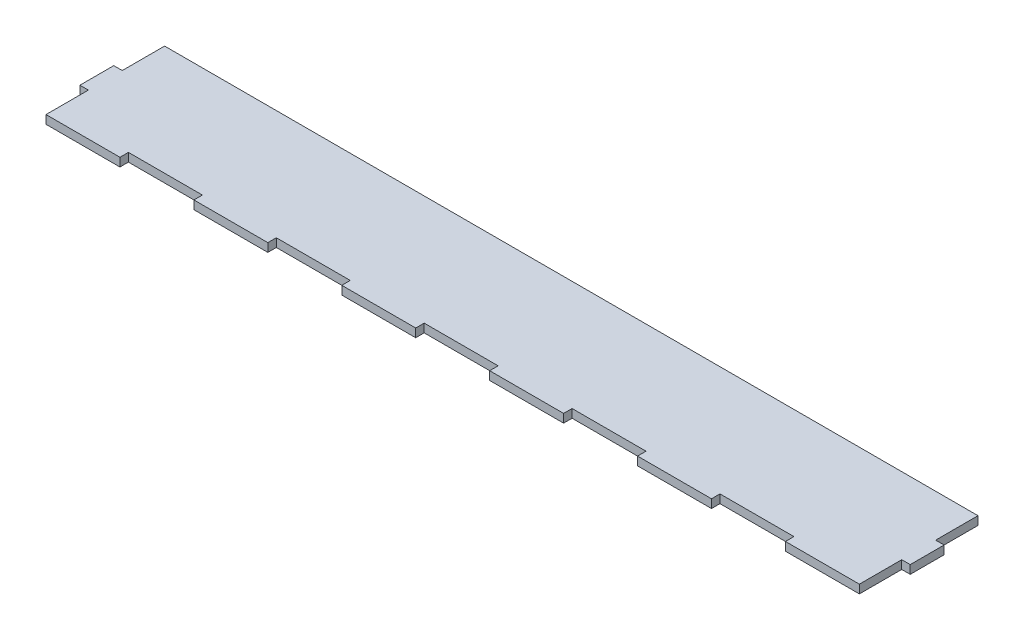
from build123d import *

# Parameters (mm, degrees)
BOSS_EXTRUDE1_DEPTH = 3.175


with BuildPart() as part:
    # Sketch1 → Boss-Extrude1 (new body)
    with BuildSketch(Plane(origin=(0, 0, 0), x_dir=(1, 0, 0), z_dir=(0, 1, 0))):
        Polygon((-152.4, 41.275), (-152.4, 25.4), (-155.575, 25.4), (-155.575, 12.7), (-152.4, 12.7), (-152.4, -3.175), (-124.690909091, -3.175), (-124.690909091, 0), (-96.981818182, 0), (-96.981818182, -3.175), (-69.272727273, -3.175), (-69.272727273, 0), (-41.563636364, 0), (-41.563636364, -3.175), (-13.854545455, -3.175), (-13.854545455, 0), (13.854545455, 0), (13.854545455, -3.175), (41.563636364, -3.175), (41.563636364, 0), (69.272727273, 0), (69.272727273, -3.175), (96.981818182, -3.175), (96.981818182, 0), (124.690909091, 0), (124.690909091, -3.175), (152.4, -3.175), (152.4, 12.7), (155.575, 12.7), (155.575, 25.4), (152.4, 25.4), (152.4, 41.275), align=None)
    extrude(amount=BOSS_EXTRUDE1_DEPTH)


solid = part.part
